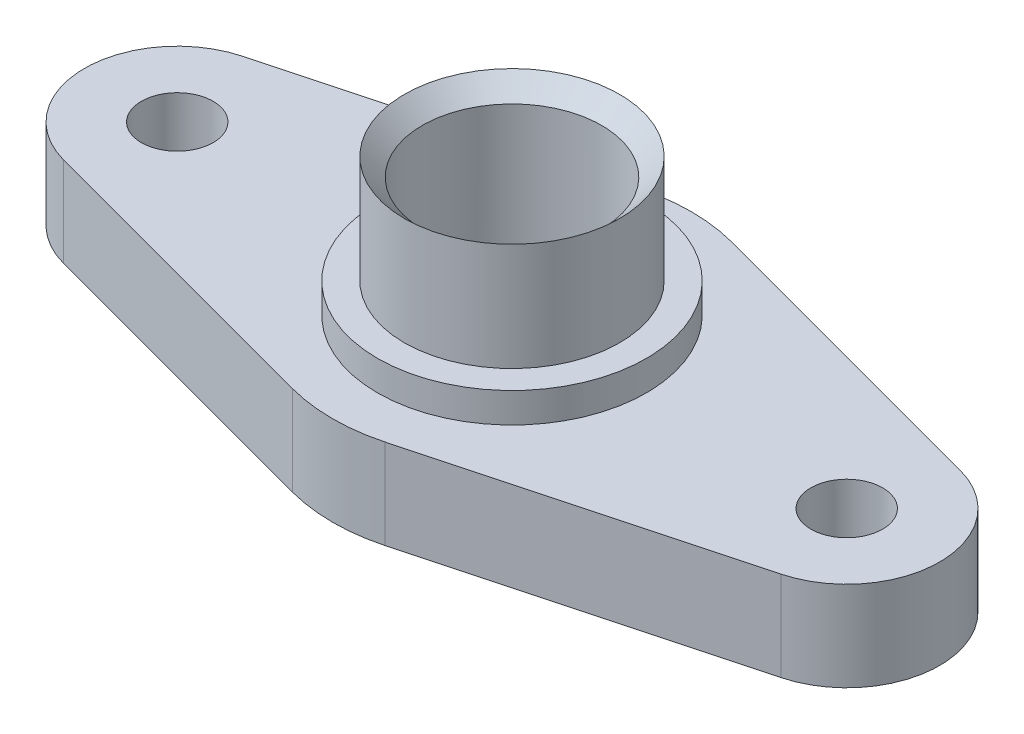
ISO-10303-21;
HEADER;
FILE_DESCRIPTION(('STEP AP214'),'2;1');
FILE_NAME('part.step','',(''),(''),'','','');
FILE_SCHEMA(('AUTOMOTIVE_DESIGN { 1 0 10303 214 1 1 1 1 }'));
ENDSEC;
DATA;
#1=APPLICATION_CONTEXT('core data for automotive mechanical design processes');
#2=APPLICATION_PROTOCOL_DEFINITION('international standard','automotive_design',2000,#1);
#3=PRODUCT_CONTEXT('',#1,'mechanical');
#4=PRODUCT('Part','Part','',(#3));
#5=PRODUCT_RELATED_PRODUCT_CATEGORY('part','',(#4));
#6=PRODUCT_DEFINITION_FORMATION('','',#4);
#7=PRODUCT_DEFINITION_CONTEXT('part definition',#1,'design');
#8=PRODUCT_DEFINITION('design','',#6,#7);
#9=PRODUCT_DEFINITION_SHAPE('','',#8);
#10=(LENGTH_UNIT() NAMED_UNIT(*) SI_UNIT(.MILLI.,.METRE.));
#11=(NAMED_UNIT(*) PLANE_ANGLE_UNIT() SI_UNIT($,.RADIAN.));
#12=(NAMED_UNIT(*) SI_UNIT($,.STERADIAN.) SOLID_ANGLE_UNIT());
#13=UNCERTAINTY_MEASURE_WITH_UNIT(LENGTH_MEASURE(1.E-05),#10,'distance_accuracy_value','');
#14=(GEOMETRIC_REPRESENTATION_CONTEXT(3) GLOBAL_UNCERTAINTY_ASSIGNED_CONTEXT((#13)) GLOBAL_UNIT_ASSIGNED_CONTEXT((#10,
#11,#12)) REPRESENTATION_CONTEXT('',''));
#15=CARTESIAN_POINT('',(0.,0.,0.));
#16=DIRECTION('',(0.,0.,1.));
#17=DIRECTION('',(1.,0.,0.));
#18=AXIS2_PLACEMENT_3D('',#15,#16,#17);
#19=CARTESIAN_POINT('',(0.,0.,0.));
#20=DIRECTION('',(0.,1.,0.));
#21=DIRECTION('',(0.,0.,1.));
#22=AXIS2_PLACEMENT_3D('',#19,#20,#21);
#23=CYLINDRICAL_SURFACE('',#22,15.);
#24=CARTESIAN_POINT('',(0.,34.9999999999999,0.));
#25=DIRECTION('',(0.,1.,0.));
#26=DIRECTION('',(0.,0.,1.));
#27=AXIS2_PLACEMENT_3D('',#24,#25,#26);
#28=CIRCLE('',#27,15.);
#29=CARTESIAN_POINT('',(0.,34.9999999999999,15.));
#30=VERTEX_POINT('',#29);
#31=EDGE_CURVE('E55',#30,#30,#28,.T.);
#32=ORIENTED_EDGE('',*,*,#31,.T.);
#33=EDGE_LOOP('',(#32));
#34=FACE_BOUND('',#33,.T.);
#35=CARTESIAN_POINT('',(0.,5.,0.));
#36=DIRECTION('',(0.,-1.,0.));
#37=DIRECTION('',(0.,0.,-1.));
#38=AXIS2_PLACEMENT_3D('',#35,#36,#37);
#39=CIRCLE('',#38,15.);
#40=CARTESIAN_POINT('',(0.,5.,-15.));
#41=VERTEX_POINT('',#40);
#42=EDGE_CURVE('E299',#41,#41,#39,.F.);
#43=ORIENTED_EDGE('',*,*,#42,.F.);
#44=EDGE_LOOP('',(#43));
#45=FACE_BOUND('',#44,.T.);
#46=ADVANCED_FACE('F45',(#34,#45),#23,.F.);
#47=CARTESIAN_POINT('',(55.986121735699,0.,0.));
#48=DIRECTION('',(0.,1.,0.));
#49=DIRECTION('',(0.,0.,1.));
#50=AXIS2_PLACEMENT_3D('',#47,#48,#49);
#51=CYLINDRICAL_SURFACE('',#50,6.);
#52=CARTESIAN_POINT('',(55.986121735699,15.,0.));
#53=DIRECTION('',(0.,1.,0.));
#54=DIRECTION('',(0.,0.,1.));
#55=AXIS2_PLACEMENT_3D('',#52,#53,#54);
#56=CIRCLE('',#55,6.);
#57=CARTESIAN_POINT('',(55.986121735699,15.,6.));
#58=VERTEX_POINT('',#57);
#59=EDGE_CURVE('E274',#58,#58,#56,.T.);
#60=ORIENTED_EDGE('',*,*,#59,.T.);
#61=EDGE_LOOP('',(#60));
#62=FACE_BOUND('',#61,.T.);
#63=CARTESIAN_POINT('',(55.986121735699,3.,0.));
#64=DIRECTION('',(0.,-1.,0.));
#65=DIRECTION('',(0.,0.,-1.));
#66=AXIS2_PLACEMENT_3D('',#63,#64,#65);
#67=CIRCLE('',#66,6.);
#68=CARTESIAN_POINT('',(55.986121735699,3.,-6.));
#69=VERTEX_POINT('',#68);
#70=EDGE_CURVE('E281',#69,#69,#67,.F.);
#71=ORIENTED_EDGE('',*,*,#70,.F.);
#72=EDGE_LOOP('',(#71));
#73=FACE_BOUND('',#72,.T.);
#74=ADVANCED_FACE('F190',(#62,#73),#51,.F.);
#75=CARTESIAN_POINT('',(-55.9861217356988,0.,7.8236028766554E-13));
#76=DIRECTION('',(0.,1.,0.));
#77=DIRECTION('',(0.,0.,1.));
#78=AXIS2_PLACEMENT_3D('',#75,#76,#77);
#79=CYLINDRICAL_SURFACE('',#78,6.);
#80=CARTESIAN_POINT('',(-55.9861217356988,15.,7.8236028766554E-13));
#81=DIRECTION('',(0.,1.,0.));
#82=DIRECTION('',(0.,0.,1.));
#83=AXIS2_PLACEMENT_3D('',#80,#81,#82);
#84=CIRCLE('',#83,6.);
#85=CARTESIAN_POINT('',(-55.9861217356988,15.,6.00000000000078));
#86=VERTEX_POINT('',#85);
#87=EDGE_CURVE('E267',#86,#86,#84,.T.);
#88=ORIENTED_EDGE('',*,*,#87,.T.);
#89=EDGE_LOOP('',(#88));
#90=FACE_BOUND('',#89,.T.);
#91=CARTESIAN_POINT('',(-55.9861217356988,3.,7.8236028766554E-13));
#92=DIRECTION('',(0.,-1.,0.));
#93=DIRECTION('',(0.,0.,-1.));
#94=AXIS2_PLACEMENT_3D('',#91,#92,#93);
#95=CIRCLE('',#94,6.);
#96=CARTESIAN_POINT('',(-55.9861217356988,3.,-5.99999999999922));
#97=VERTEX_POINT('',#96);
#98=EDGE_CURVE('E291',#97,#97,#95,.F.);
#99=ORIENTED_EDGE('',*,*,#98,.F.);
#100=EDGE_LOOP('',(#99));
#101=FACE_BOUND('',#100,.T.);
#102=ADVANCED_FACE('F195',(#90,#101),#79,.F.);
#103=CARTESIAN_POINT('',(-7.75490971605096,15.,-28.9803621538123));
#104=DIRECTION('',(-0.258496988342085,0.,-0.966012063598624));
#105=DIRECTION('',(-0.966012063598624,0.,0.258496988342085));
#106=AXIS2_PLACEMENT_3D('',#103,#104,#105);
#107=PLANE('',#106);
#108=DIRECTION('',(0.966012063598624,0.,-0.258496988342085));
#109=VECTOR('',#108,1.);
#110=CARTESIAN_POINT('',(-7.75490971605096,0.,-28.9803621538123));
#111=LINE('',#110,#109);
#112=CARTESIAN_POINT('',(-60.,0.,-14.9999999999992));
#113=VERTEX_POINT('',#112);
#114=CARTESIAN_POINT('',(-7.75490971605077,0.,-28.9803621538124));
#115=VERTEX_POINT('',#114);
#116=EDGE_CURVE('E143',#113,#115,#111,.T.);
#117=ORIENTED_EDGE('',*,*,#116,.F.);
#118=DIRECTION('',(0.,-1.,0.));
#119=VECTOR('',#118,1.);
#120=CARTESIAN_POINT('',(-60.,15.,-14.9999999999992));
#121=LINE('',#120,#119);
#122=CARTESIAN_POINT('',(-60.,15.,-14.9999999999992));
#123=VERTEX_POINT('',#122);
#124=EDGE_CURVE('E103',#123,#113,#121,.T.);
#125=ORIENTED_EDGE('',*,*,#124,.F.);
#126=DIRECTION('',(0.966012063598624,0.,-0.258496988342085));
#127=VECTOR('',#126,1.);
#128=CARTESIAN_POINT('',(-7.75490971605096,15.,-28.9803621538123));
#129=LINE('',#128,#127);
#130=CARTESIAN_POINT('',(-7.75490971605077,15.,-28.9803621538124));
#131=VERTEX_POINT('',#130);
#132=EDGE_CURVE('E161',#123,#131,#129,.T.);
#133=ORIENTED_EDGE('',*,*,#132,.T.);
#134=DIRECTION('',(0.,-1.,0.));
#135=VECTOR('',#134,1.);
#136=CARTESIAN_POINT('',(-7.75490971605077,15.,-28.9803621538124));
#137=LINE('',#136,#135);
#138=EDGE_CURVE('E98',#131,#115,#137,.T.);
#139=ORIENTED_EDGE('',*,*,#138,.T.);
#140=EDGE_LOOP('',(#117,#125,#133,#139));
#141=FACE_BOUND('',#140,.T.);
#142=ADVANCED_FACE('F241',(#141),#107,.T.);
#143=CARTESIAN_POINT('',(-55.9861217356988,15.,7.8236028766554E-13));
#144=DIRECTION('',(0.,-1.,0.));
#145=DIRECTION('',(0.,0.,-1.));
#146=AXIS2_PLACEMENT_3D('',#143,#144,#145);
#147=CYLINDRICAL_SURFACE('',#146,15.5277563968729);
#148=CARTESIAN_POINT('',(-55.9861217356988,0.,7.8236028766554E-13));
#149=DIRECTION('',(0.,1.,0.));
#150=DIRECTION('',(0.,0.,1.));
#151=AXIS2_PLACEMENT_3D('',#148,#149,#150);
#152=CIRCLE('',#151,15.5277563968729);
#153=CARTESIAN_POINT('',(-59.9999999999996,0.,15.0000000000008));
#154=VERTEX_POINT('',#153);
#155=EDGE_CURVE('E146',#113,#154,#152,.T.);
#156=ORIENTED_EDGE('',*,*,#155,.T.);
#157=DIRECTION('',(0.,-1.,0.));
#158=VECTOR('',#157,1.);
#159=CARTESIAN_POINT('',(-59.9999999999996,15.,15.0000000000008));
#160=LINE('',#159,#158);
#161=CARTESIAN_POINT('',(-59.9999999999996,15.,15.0000000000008));
#162=VERTEX_POINT('',#161);
#163=EDGE_CURVE('E170',#162,#154,#160,.T.);
#164=ORIENTED_EDGE('',*,*,#163,.F.);
#165=CARTESIAN_POINT('',(-55.9861217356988,15.,7.8236028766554E-13));
#166=DIRECTION('',(0.,1.,0.));
#167=DIRECTION('',(0.,0.,1.));
#168=AXIS2_PLACEMENT_3D('',#165,#166,#167);
#169=CIRCLE('',#168,15.5277563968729);
#170=EDGE_CURVE('E258',#123,#162,#169,.T.);
#171=ORIENTED_EDGE('',*,*,#170,.F.);
#172=ORIENTED_EDGE('',*,*,#124,.T.);
#173=EDGE_LOOP('',(#156,#164,#171,#172));
#174=FACE_BOUND('',#173,.T.);
#175=ADVANCED_FACE('F238',(#174),#147,.T.);
#176=CARTESIAN_POINT('',(-7.75490971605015,15.,28.9803621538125));
#177=DIRECTION('',(0.258496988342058,0.,-0.966012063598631));
#178=DIRECTION('',(-0.966012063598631,0.,-0.258496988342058));
#179=AXIS2_PLACEMENT_3D('',#176,#177,#178);
#180=PLANE('',#179);
#181=DIRECTION('',(0.966012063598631,0.,0.258496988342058));
#182=VECTOR('',#181,1.);
#183=CARTESIAN_POINT('',(-7.75490971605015,0.,28.9803621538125));
#184=LINE('',#183,#182);
#185=CARTESIAN_POINT('',(-7.75490971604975,0.,28.9803621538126));
#186=VERTEX_POINT('',#185);
#187=EDGE_CURVE('E149',#154,#186,#184,.T.);
#188=ORIENTED_EDGE('',*,*,#187,.T.);
#189=DIRECTION('',(0.,-1.,0.));
#190=VECTOR('',#189,1.);
#191=CARTESIAN_POINT('',(-7.75490971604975,15.,28.9803621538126));
#192=LINE('',#191,#190);
#193=CARTESIAN_POINT('',(-7.75490971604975,15.,28.9803621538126));
#194=VERTEX_POINT('',#193);
#195=EDGE_CURVE('E167',#194,#186,#192,.T.);
#196=ORIENTED_EDGE('',*,*,#195,.F.);
#197=DIRECTION('',(0.966012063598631,0.,0.258496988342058));
#198=VECTOR('',#197,1.);
#199=CARTESIAN_POINT('',(-7.75490971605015,15.,28.9803621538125));
#200=LINE('',#199,#198);
#201=EDGE_CURVE('E256',#162,#194,#200,.T.);
#202=ORIENTED_EDGE('',*,*,#201,.F.);
#203=ORIENTED_EDGE('',*,*,#163,.T.);
#204=EDGE_LOOP('',(#188,#196,#202,#203));
#205=FACE_BOUND('',#204,.T.);
#206=ADVANCED_FACE('F234',(#205),#180,.F.);
#207=CARTESIAN_POINT('',(0.,15.,0.));
#208=DIRECTION('',(0.,-1.,0.));
#209=DIRECTION('',(0.,0.,-1.));
#210=AXIS2_PLACEMENT_3D('',#207,#208,#209);
#211=CYLINDRICAL_SURFACE('',#210,30.0000002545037);
#212=CARTESIAN_POINT('',(0.,0.,0.));
#213=DIRECTION('',(0.,1.,0.));
#214=DIRECTION('',(0.,0.,1.));
#215=AXIS2_PLACEMENT_3D('',#212,#213,#214);
#216=CIRCLE('',#215,30.0000002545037);
#217=CARTESIAN_POINT('',(7.75490971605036,0.,28.9803621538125));
#218=VERTEX_POINT('',#217);
#219=EDGE_CURVE('E151',#186,#218,#216,.T.);
#220=ORIENTED_EDGE('',*,*,#219,.T.);
#221=DIRECTION('',(0.,-1.,0.));
#222=VECTOR('',#221,1.);
#223=CARTESIAN_POINT('',(7.75490971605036,15.,28.9803621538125));
#224=LINE('',#223,#222);
#225=CARTESIAN_POINT('',(7.75490971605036,15.,28.9803621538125));
#226=VERTEX_POINT('',#225);
#227=EDGE_CURVE('E165',#226,#218,#224,.T.);
#228=ORIENTED_EDGE('',*,*,#227,.F.);
#229=CARTESIAN_POINT('',(0.,15.,0.));
#230=DIRECTION('',(0.,1.,0.));
#231=DIRECTION('',(0.,0.,1.));
#232=AXIS2_PLACEMENT_3D('',#229,#230,#231);
#233=CIRCLE('',#232,30.0000002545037);
#234=EDGE_CURVE('E138',#194,#226,#233,.T.);
#235=ORIENTED_EDGE('',*,*,#234,.F.);
#236=ORIENTED_EDGE('',*,*,#195,.T.);
#237=EDGE_LOOP('',(#220,#228,#235,#236));
#238=FACE_BOUND('',#237,.T.);
#239=ADVANCED_FACE('F230',(#238),#211,.T.);
#240=CARTESIAN_POINT('',(7.75490971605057,15.,28.9803621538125));
#241=DIRECTION('',(0.258496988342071,0.,0.966012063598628));
#242=DIRECTION('',(0.966012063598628,0.,-0.258496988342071));
#243=AXIS2_PLACEMENT_3D('',#240,#241,#242);
#244=PLANE('',#243);
#245=DIRECTION('',(-0.966012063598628,0.,0.258496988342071));
#246=VECTOR('',#245,1.);
#247=CARTESIAN_POINT('',(7.75490971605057,0.,28.9803621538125));
#248=LINE('',#247,#246);
#249=CARTESIAN_POINT('',(60.,0.,15.));
#250=VERTEX_POINT('',#249);
#251=EDGE_CURVE('E154',#250,#218,#248,.T.);
#252=ORIENTED_EDGE('',*,*,#251,.F.);
#253=DIRECTION('',(0.,-1.,0.));
#254=VECTOR('',#253,1.);
#255=CARTESIAN_POINT('',(60.,15.,15.));
#256=LINE('',#255,#254);
#257=CARTESIAN_POINT('',(60.,15.,15.));
#258=VERTEX_POINT('',#257);
#259=EDGE_CURVE('E127',#258,#250,#256,.T.);
#260=ORIENTED_EDGE('',*,*,#259,.F.);
#261=DIRECTION('',(-0.966012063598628,0.,0.258496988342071));
#262=VECTOR('',#261,1.);
#263=CARTESIAN_POINT('',(7.75490971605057,15.,28.9803621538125));
#264=LINE('',#263,#262);
#265=EDGE_CURVE('E136',#258,#226,#264,.T.);
#266=ORIENTED_EDGE('',*,*,#265,.T.);
#267=ORIENTED_EDGE('',*,*,#227,.T.);
#268=EDGE_LOOP('',(#252,#260,#266,#267));
#269=FACE_BOUND('',#268,.T.);
#270=ADVANCED_FACE('F227',(#269),#244,.T.);
#271=CARTESIAN_POINT('',(55.986121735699,15.,0.));
#272=DIRECTION('',(0.,-1.,0.));
#273=DIRECTION('',(0.,0.,-1.));
#274=AXIS2_PLACEMENT_3D('',#271,#272,#273);
#275=CYLINDRICAL_SURFACE('',#274,15.5277563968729);
#276=CARTESIAN_POINT('',(55.986121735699,0.,0.));
#277=DIRECTION('',(0.,1.,0.));
#278=DIRECTION('',(0.,0.,1.));
#279=AXIS2_PLACEMENT_3D('',#276,#277,#278);
#280=CIRCLE('',#279,15.5277563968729);
#281=CARTESIAN_POINT('',(60.,0.,-15.));
#282=VERTEX_POINT('',#281);
#283=EDGE_CURVE('E126',#282,#250,#280,.F.);
#284=ORIENTED_EDGE('',*,*,#283,.F.);
#285=DIRECTION('',(0.,-1.,0.));
#286=VECTOR('',#285,1.);
#287=CARTESIAN_POINT('',(60.,15.,-15.));
#288=LINE('',#287,#286);
#289=CARTESIAN_POINT('',(60.,15.,-15.));
#290=VERTEX_POINT('',#289);
#291=EDGE_CURVE('E120',#290,#282,#288,.T.);
#292=ORIENTED_EDGE('',*,*,#291,.F.);
#293=CARTESIAN_POINT('',(55.986121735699,15.,0.));
#294=DIRECTION('',(0.,1.,0.));
#295=DIRECTION('',(0.,0.,1.));
#296=AXIS2_PLACEMENT_3D('',#293,#294,#295);
#297=CIRCLE('',#296,15.5277563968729);
#298=EDGE_CURVE('E124',#290,#258,#297,.F.);
#299=ORIENTED_EDGE('',*,*,#298,.T.);
#300=ORIENTED_EDGE('',*,*,#259,.T.);
#301=EDGE_LOOP('',(#284,#292,#299,#300));
#302=FACE_BOUND('',#301,.T.);
#303=ADVANCED_FACE('F122',(#302),#275,.T.);
#304=CARTESIAN_POINT('',(7.75490971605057,15.,-28.9803621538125));
#305=DIRECTION('',(-0.258496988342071,0.,0.966012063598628));
#306=DIRECTION('',(0.966012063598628,0.,0.258496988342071));
#307=AXIS2_PLACEMENT_3D('',#304,#305,#306);
#308=PLANE('',#307);
#309=DIRECTION('',(-0.966012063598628,0.,-0.258496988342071));
#310=VECTOR('',#309,1.);
#311=CARTESIAN_POINT('',(7.75490971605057,0.,-28.9803621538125));
#312=LINE('',#311,#310);
#313=CARTESIAN_POINT('',(7.75490971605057,0.,-28.9803621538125));
#314=VERTEX_POINT('',#313);
#315=EDGE_CURVE('E91',#282,#314,#312,.T.);
#316=ORIENTED_EDGE('',*,*,#315,.T.);
#317=DIRECTION('',(0.,-1.,0.));
#318=VECTOR('',#317,1.);
#319=CARTESIAN_POINT('',(7.75490971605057,15.,-28.9803621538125));
#320=LINE('',#319,#318);
#321=CARTESIAN_POINT('',(7.75490971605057,15.,-28.9803621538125));
#322=VERTEX_POINT('',#321);
#323=EDGE_CURVE('E128',#322,#314,#320,.T.);
#324=ORIENTED_EDGE('',*,*,#323,.F.);
#325=DIRECTION('',(-0.966012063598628,0.,-0.258496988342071));
#326=VECTOR('',#325,1.);
#327=CARTESIAN_POINT('',(7.75490971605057,15.,-28.9803621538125));
#328=LINE('',#327,#326);
#329=EDGE_CURVE('E130',#290,#322,#328,.T.);
#330=ORIENTED_EDGE('',*,*,#329,.F.);
#331=ORIENTED_EDGE('',*,*,#291,.T.);
#332=EDGE_LOOP('',(#316,#324,#330,#331));
#333=FACE_BOUND('',#332,.T.);
#334=ADVANCED_FACE('F131',(#333),#308,.F.);
#335=CARTESIAN_POINT('',(0.,15.,0.));
#336=DIRECTION('',(0.,-1.,0.));
#337=DIRECTION('',(0.,0.,-1.));
#338=AXIS2_PLACEMENT_3D('',#335,#336,#337);
#339=CYLINDRICAL_SURFACE('',#338,30.0000002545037);
#340=CARTESIAN_POINT('',(0.,0.,0.));
#341=DIRECTION('',(0.,1.,0.));
#342=DIRECTION('',(0.,0.,1.));
#343=AXIS2_PLACEMENT_3D('',#340,#341,#342);
#344=CIRCLE('',#343,30.0000002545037);
#345=EDGE_CURVE('E159',#314,#115,#344,.T.);
#346=ORIENTED_EDGE('',*,*,#345,.T.);
#347=ORIENTED_EDGE('',*,*,#138,.F.);
#348=CARTESIAN_POINT('',(0.,15.,0.));
#349=DIRECTION('',(0.,1.,0.));
#350=DIRECTION('',(0.,0.,1.));
#351=AXIS2_PLACEMENT_3D('',#348,#349,#350);
#352=CIRCLE('',#351,30.0000002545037);
#353=EDGE_CURVE('E63',#322,#131,#352,.T.);
#354=ORIENTED_EDGE('',*,*,#353,.F.);
#355=ORIENTED_EDGE('',*,*,#323,.T.);
#356=EDGE_LOOP('',(#346,#347,#354,#355));
#357=FACE_BOUND('',#356,.T.);
#358=ADVANCED_FACE('F215',(#357),#339,.T.);
#359=CARTESIAN_POINT('',(0.,15.,0.));
#360=DIRECTION('',(0.,1.,0.));
#361=DIRECTION('',(0.,0.,1.));
#362=AXIS2_PLACEMENT_3D('',#359,#360,#361);
#363=PLANE('',#362);
#364=ORIENTED_EDGE('',*,*,#87,.F.);
#365=EDGE_LOOP('',(#364));
#366=FACE_BOUND('',#365,.T.);
#367=ORIENTED_EDGE('',*,*,#59,.F.);
#368=EDGE_LOOP('',(#367));
#369=FACE_BOUND('',#368,.T.);
#370=CARTESIAN_POINT('',(0.,15.,0.));
#371=DIRECTION('',(0.,1.,0.));
#372=DIRECTION('',(0.,0.,1.));
#373=AXIS2_PLACEMENT_3D('',#370,#371,#372);
#374=CIRCLE('',#373,22.5);
#375=CARTESIAN_POINT('',(0.,15.,22.5));
#376=VERTEX_POINT('',#375);
#377=EDGE_CURVE('E263',#376,#376,#374,.T.);
#378=ORIENTED_EDGE('',*,*,#377,.F.);
#379=EDGE_LOOP('',(#378));
#380=FACE_BOUND('',#379,.T.);
#381=ORIENTED_EDGE('',*,*,#132,.F.);
#382=ORIENTED_EDGE('',*,*,#170,.T.);
#383=ORIENTED_EDGE('',*,*,#201,.T.);
#384=ORIENTED_EDGE('',*,*,#234,.T.);
#385=ORIENTED_EDGE('',*,*,#265,.F.);
#386=ORIENTED_EDGE('',*,*,#298,.F.);
#387=ORIENTED_EDGE('',*,*,#329,.T.);
#388=ORIENTED_EDGE('',*,*,#353,.T.);
#389=EDGE_LOOP('',(#381,#382,#383,#384,#385,#386,#387,#388));
#390=FACE_BOUND('',#389,.T.);
#391=ADVANCED_FACE('F134',(#366,#369,#380,#390),#363,.T.);
#392=CARTESIAN_POINT('',(0.,0.,0.));
#393=DIRECTION('',(0.,1.,0.));
#394=DIRECTION('',(0.,0.,1.));
#395=AXIS2_PLACEMENT_3D('',#392,#393,#394);
#396=PLANE('',#395);
#397=CARTESIAN_POINT('',(0.,0.,0.));
#398=DIRECTION('',(0.,-1.,0.));
#399=DIRECTION('',(0.,0.,-1.));
#400=AXIS2_PLACEMENT_3D('',#397,#398,#399);
#401=CIRCLE('',#400,18.);
#402=CARTESIAN_POINT('',(0.,0.,-18.));
#403=VERTEX_POINT('',#402);
#404=EDGE_CURVE('E296',#403,#403,#401,.T.);
#405=ORIENTED_EDGE('',*,*,#404,.F.);
#406=EDGE_LOOP('',(#405));
#407=FACE_BOUND('',#406,.T.);
#408=CARTESIAN_POINT('',(-55.9861217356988,0.,7.8236028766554E-13));
#409=DIRECTION('',(0.,-1.,0.));
#410=DIRECTION('',(0.,0.,-1.));
#411=AXIS2_PLACEMENT_3D('',#408,#409,#410);
#412=CIRCLE('',#411,9.);
#413=CARTESIAN_POINT('',(-55.9861217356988,0.,-8.99999999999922));
#414=VERTEX_POINT('',#413);
#415=EDGE_CURVE('E286',#414,#414,#412,.T.);
#416=ORIENTED_EDGE('',*,*,#415,.F.);
#417=EDGE_LOOP('',(#416));
#418=FACE_BOUND('',#417,.T.);
#419=CARTESIAN_POINT('',(55.986121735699,0.,0.));
#420=DIRECTION('',(0.,-1.,0.));
#421=DIRECTION('',(0.,0.,-1.));
#422=AXIS2_PLACEMENT_3D('',#419,#420,#421);
#423=CIRCLE('',#422,9.);
#424=CARTESIAN_POINT('',(55.986121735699,0.,-9.));
#425=VERTEX_POINT('',#424);
#426=EDGE_CURVE('E278',#425,#425,#423,.T.);
#427=ORIENTED_EDGE('',*,*,#426,.F.);
#428=EDGE_LOOP('',(#427));
#429=FACE_BOUND('',#428,.T.);
#430=ORIENTED_EDGE('',*,*,#116,.T.);
#431=ORIENTED_EDGE('',*,*,#345,.F.);
#432=ORIENTED_EDGE('',*,*,#315,.F.);
#433=ORIENTED_EDGE('',*,*,#283,.T.);
#434=ORIENTED_EDGE('',*,*,#251,.T.);
#435=ORIENTED_EDGE('',*,*,#219,.F.);
#436=ORIENTED_EDGE('',*,*,#187,.F.);
#437=ORIENTED_EDGE('',*,*,#155,.F.);
#438=EDGE_LOOP('',(#430,#431,#432,#433,#434,#435,#436,#437));
#439=FACE_BOUND('',#438,.T.);
#440=ADVANCED_FACE('F211',(#407,#418,#429,#439),#396,.F.);
#441=CARTESIAN_POINT('',(0.,20.,0.));
#442=DIRECTION('',(0.,-1.,0.));
#443=DIRECTION('',(0.,0.,-1.));
#444=AXIS2_PLACEMENT_3D('',#441,#442,#443);
#445=CYLINDRICAL_SURFACE('',#444,22.5);
#446=CARTESIAN_POINT('',(0.,20.,0.));
#447=DIRECTION('',(0.,1.,0.));
#448=DIRECTION('',(0.,0.,1.));
#449=AXIS2_PLACEMENT_3D('',#446,#447,#448);
#450=CIRCLE('',#449,22.5);
#451=CARTESIAN_POINT('',(0.,20.,22.5));
#452=VERTEX_POINT('',#451);
#453=EDGE_CURVE('E147',#452,#452,#450,.T.);
#454=ORIENTED_EDGE('',*,*,#453,.F.);
#455=EDGE_LOOP('',(#454));
#456=FACE_BOUND('',#455,.T.);
#457=ORIENTED_EDGE('',*,*,#377,.T.);
#458=EDGE_LOOP('',(#457));
#459=FACE_BOUND('',#458,.T.);
#460=ADVANCED_FACE('F207',(#456,#459),#445,.T.);
#461=CARTESIAN_POINT('',(0.,20.,0.));
#462=DIRECTION('',(0.,1.,0.));
#463=DIRECTION('',(0.,0.,1.));
#464=AXIS2_PLACEMENT_3D('',#461,#462,#463);
#465=PLANE('',#464);
#466=CARTESIAN_POINT('',(0.,20.,0.));
#467=DIRECTION('',(0.,1.,0.));
#468=DIRECTION('',(0.,0.,1.));
#469=AXIS2_PLACEMENT_3D('',#466,#467,#468);
#470=CIRCLE('',#469,18.);
#471=CARTESIAN_POINT('',(0.,20.,18.));
#472=VERTEX_POINT('',#471);
#473=EDGE_CURVE('E266',#472,#472,#470,.T.);
#474=ORIENTED_EDGE('',*,*,#473,.F.);
#475=EDGE_LOOP('',(#474));
#476=FACE_BOUND('',#475,.T.);
#477=ORIENTED_EDGE('',*,*,#453,.T.);
#478=EDGE_LOOP('',(#477));
#479=FACE_BOUND('',#478,.T.);
#480=ADVANCED_FACE('F203',(#476,#479),#465,.T.);
#481=CARTESIAN_POINT('',(0.,40.,0.));
#482=DIRECTION('',(0.,-1.,0.));
#483=DIRECTION('',(0.,0.,-1.));
#484=AXIS2_PLACEMENT_3D('',#481,#482,#483);
#485=CYLINDRICAL_SURFACE('',#484,18.);
#486=CARTESIAN_POINT('',(0.,37.9999999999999,0.));
#487=DIRECTION('',(0.,1.,0.));
#488=DIRECTION('',(0.,0.,1.));
#489=AXIS2_PLACEMENT_3D('',#486,#487,#488);
#490=CIRCLE('',#489,18.);
#491=CARTESIAN_POINT('',(0.,37.9999999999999,18.));
#492=VERTEX_POINT('',#491);
#493=EDGE_CURVE('E11',#492,#492,#490,.F.);
#494=ORIENTED_EDGE('',*,*,#493,.T.);
#495=EDGE_LOOP('',(#494));
#496=FACE_BOUND('',#495,.T.);
#497=ORIENTED_EDGE('',*,*,#473,.T.);
#498=EDGE_LOOP('',(#497));
#499=FACE_BOUND('',#498,.T.);
#500=ADVANCED_FACE('F200',(#496,#499),#485,.T.);
#501=CARTESIAN_POINT('',(-55.9861217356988,3.,7.8236028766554E-13));
#502=DIRECTION('',(0.,-1.,0.));
#503=DIRECTION('',(0.,0.,-1.));
#504=AXIS2_PLACEMENT_3D('',#501,#502,#503);
#505=CYLINDRICAL_SURFACE('',#504,9.);
#506=CARTESIAN_POINT('',(-55.9861217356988,3.,7.8236028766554E-13));
#507=DIRECTION('',(0.,-1.,0.));
#508=DIRECTION('',(0.,0.,-1.));
#509=AXIS2_PLACEMENT_3D('',#506,#507,#508);
#510=CIRCLE('',#509,9.);
#511=CARTESIAN_POINT('',(-55.9861217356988,3.,-8.99999999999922));
#512=VERTEX_POINT('',#511);
#513=EDGE_CURVE('E277',#512,#512,#510,.T.);
#514=ORIENTED_EDGE('',*,*,#513,.F.);
#515=EDGE_LOOP('',(#514));
#516=FACE_BOUND('',#515,.T.);
#517=ORIENTED_EDGE('',*,*,#415,.T.);
#518=EDGE_LOOP('',(#517));
#519=FACE_BOUND('',#518,.T.);
#520=ADVANCED_FACE('F202',(#516,#519),#505,.F.);
#521=CARTESIAN_POINT('',(0.,3.,0.));
#522=DIRECTION('',(0.,-1.,0.));
#523=DIRECTION('',(0.,0.,-1.));
#524=AXIS2_PLACEMENT_3D('',#521,#522,#523);
#525=PLANE('',#524);
#526=ORIENTED_EDGE('',*,*,#98,.T.);
#527=EDGE_LOOP('',(#526));
#528=FACE_BOUND('',#527,.T.);
#529=ORIENTED_EDGE('',*,*,#513,.T.);
#530=EDGE_LOOP('',(#529));
#531=FACE_BOUND('',#530,.T.);
#532=ADVANCED_FACE('F319',(#528,#531),#525,.T.);
#533=CARTESIAN_POINT('',(55.986121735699,3.,0.));
#534=DIRECTION('',(0.,-1.,0.));
#535=DIRECTION('',(0.,0.,-1.));
#536=AXIS2_PLACEMENT_3D('',#533,#534,#535);
#537=CYLINDRICAL_SURFACE('',#536,9.);
#538=CARTESIAN_POINT('',(55.986121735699,3.,0.));
#539=DIRECTION('',(0.,-1.,0.));
#540=DIRECTION('',(0.,0.,-1.));
#541=AXIS2_PLACEMENT_3D('',#538,#539,#540);
#542=CIRCLE('',#541,9.);
#543=CARTESIAN_POINT('',(55.986121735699,3.,-9.));
#544=VERTEX_POINT('',#543);
#545=EDGE_CURVE('E283',#544,#544,#542,.T.);
#546=ORIENTED_EDGE('',*,*,#545,.F.);
#547=EDGE_LOOP('',(#546));
#548=FACE_BOUND('',#547,.T.);
#549=ORIENTED_EDGE('',*,*,#426,.T.);
#550=EDGE_LOOP('',(#549));
#551=FACE_BOUND('',#550,.T.);
#552=ADVANCED_FACE('F317',(#548,#551),#537,.F.);
#553=CARTESIAN_POINT('',(0.,3.,0.));
#554=DIRECTION('',(0.,-1.,0.));
#555=DIRECTION('',(0.,0.,-1.));
#556=AXIS2_PLACEMENT_3D('',#553,#554,#555);
#557=PLANE('',#556);
#558=ORIENTED_EDGE('',*,*,#70,.T.);
#559=EDGE_LOOP('',(#558));
#560=FACE_BOUND('',#559,.T.);
#561=ORIENTED_EDGE('',*,*,#545,.T.);
#562=EDGE_LOOP('',(#561));
#563=FACE_BOUND('',#562,.T.);
#564=ADVANCED_FACE('F309',(#560,#563),#557,.T.);
#565=CARTESIAN_POINT('',(0.,5.,0.));
#566=DIRECTION('',(0.,-1.,0.));
#567=DIRECTION('',(0.,0.,-1.));
#568=AXIS2_PLACEMENT_3D('',#565,#566,#567);
#569=CYLINDRICAL_SURFACE('',#568,18.);
#570=CARTESIAN_POINT('',(0.,5.,0.));
#571=DIRECTION('',(0.,-1.,0.));
#572=DIRECTION('',(0.,0.,-1.));
#573=AXIS2_PLACEMENT_3D('',#570,#571,#572);
#574=CIRCLE('',#573,18.);
#575=CARTESIAN_POINT('',(0.,5.,-18.));
#576=VERTEX_POINT('',#575);
#577=EDGE_CURVE('E282',#576,#576,#574,.T.);
#578=ORIENTED_EDGE('',*,*,#577,.F.);
#579=EDGE_LOOP('',(#578));
#580=FACE_BOUND('',#579,.T.);
#581=ORIENTED_EDGE('',*,*,#404,.T.);
#582=EDGE_LOOP('',(#581));
#583=FACE_BOUND('',#582,.T.);
#584=ADVANCED_FACE('F185',(#580,#583),#569,.F.);
#585=CARTESIAN_POINT('',(0.,5.,0.));
#586=DIRECTION('',(0.,-1.,0.));
#587=DIRECTION('',(0.,0.,-1.));
#588=AXIS2_PLACEMENT_3D('',#585,#586,#587);
#589=PLANE('',#588);
#590=ORIENTED_EDGE('',*,*,#42,.T.);
#591=EDGE_LOOP('',(#590));
#592=FACE_BOUND('',#591,.T.);
#593=ORIENTED_EDGE('',*,*,#577,.T.);
#594=EDGE_LOOP('',(#593));
#595=FACE_BOUND('',#594,.T.);
#596=ADVANCED_FACE('F179',(#592,#595),#589,.T.);
#597=CARTESIAN_POINT('',(0.,34.9999999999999,0.));
#598=DIRECTION('',(0.,1.,0.));
#599=DIRECTION('',(0.,0.,1.));
#600=AXIS2_PLACEMENT_3D('',#597,#598,#599);
#601=CONICAL_SURFACE('',#600,15.,0.785398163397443);
#602=ORIENTED_EDGE('',*,*,#493,.F.);
#603=EDGE_LOOP('',(#602));
#604=FACE_BOUND('',#603,.T.);
#605=ORIENTED_EDGE('',*,*,#31,.F.);
#606=EDGE_LOOP('',(#605));
#607=FACE_BOUND('',#606,.T.);
#608=ADVANCED_FACE('F48',(#604,#607),#601,.F.);
#609=CLOSED_SHELL('',(#46,#74,#102,#142,#175,#206,#239,#270,#303,#334,#358,#391,#440,#460,#480,
#500,#520,#532,#552,#564,#584,#596,#608));
#610=MANIFOLD_SOLID_BREP('B2',#609);
#611=ADVANCED_BREP_SHAPE_REPRESENTATION('',(#18,#610),#14);
#612=SHAPE_DEFINITION_REPRESENTATION(#9,#611);
ENDSEC;
END-ISO-10303-21;
